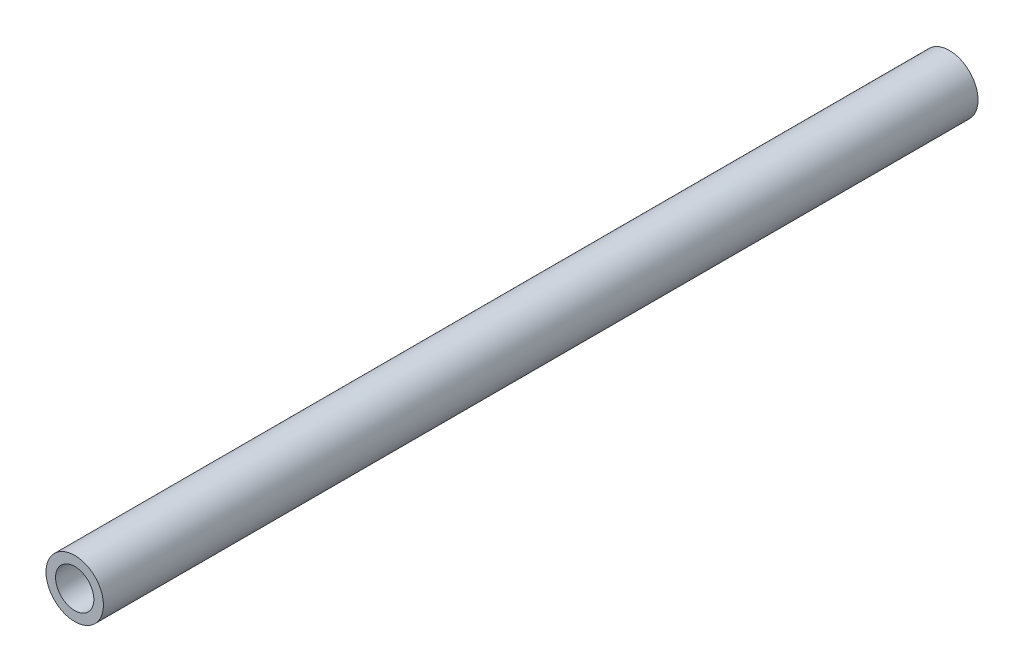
ISO-10303-21;
HEADER;
FILE_DESCRIPTION(('STEP AP214'),'2;1');
FILE_NAME('part.step','',(''),(''),'','','');
FILE_SCHEMA(('AUTOMOTIVE_DESIGN { 1 0 10303 214 1 1 1 1 }'));
ENDSEC;
DATA;
#1=APPLICATION_CONTEXT('core data for automotive mechanical design processes');
#2=APPLICATION_PROTOCOL_DEFINITION('international standard','automotive_design',2000,#1);
#3=PRODUCT_CONTEXT('',#1,'mechanical');
#4=PRODUCT('Part','Part','',(#3));
#5=PRODUCT_RELATED_PRODUCT_CATEGORY('part','',(#4));
#6=PRODUCT_DEFINITION_FORMATION('','',#4);
#7=PRODUCT_DEFINITION_CONTEXT('part definition',#1,'design');
#8=PRODUCT_DEFINITION('design','',#6,#7);
#9=PRODUCT_DEFINITION_SHAPE('','',#8);
#10=(LENGTH_UNIT() NAMED_UNIT(*) SI_UNIT(.MILLI.,.METRE.));
#11=(NAMED_UNIT(*) PLANE_ANGLE_UNIT() SI_UNIT($,.RADIAN.));
#12=(NAMED_UNIT(*) SI_UNIT($,.STERADIAN.) SOLID_ANGLE_UNIT());
#13=UNCERTAINTY_MEASURE_WITH_UNIT(LENGTH_MEASURE(1.E-05),#10,'distance_accuracy_value','');
#14=(GEOMETRIC_REPRESENTATION_CONTEXT(3) GLOBAL_UNCERTAINTY_ASSIGNED_CONTEXT((#13)) GLOBAL_UNIT_ASSIGNED_CONTEXT((#10,
#11,#12)) REPRESENTATION_CONTEXT('',''));
#15=CARTESIAN_POINT('',(0.,0.,0.));
#16=DIRECTION('',(0.,0.,1.));
#17=DIRECTION('',(1.,0.,0.));
#18=AXIS2_PLACEMENT_3D('',#15,#16,#17);
#19=CARTESIAN_POINT('',(0.,0.,45.7));
#20=DIRECTION('',(0.,0.,1.));
#21=DIRECTION('',(1.,0.,0.));
#22=AXIS2_PLACEMENT_3D('',#19,#20,#21);
#23=PLANE('',#22);
#24=CARTESIAN_POINT('',(0.,0.,45.7));
#25=DIRECTION('',(0.,0.,1.));
#26=DIRECTION('',(1.,0.,0.));
#27=AXIS2_PLACEMENT_3D('',#24,#25,#26);
#28=CIRCLE('',#27,3.);
#29=CARTESIAN_POINT('',(-3.,0.,45.7));
#30=VERTEX_POINT('',#29);
#31=EDGE_CURVE('E10',#30,#30,#28,.T.);
#32=ORIENTED_EDGE('',*,*,#31,.T.);
#33=EDGE_LOOP('',(#32));
#34=FACE_BOUND('',#33,.T.);
#35=CARTESIAN_POINT('',(0.,0.,45.7));
#36=DIRECTION('',(0.,0.,1.));
#37=DIRECTION('',(1.,0.,0.));
#38=AXIS2_PLACEMENT_3D('',#35,#36,#37);
#39=CIRCLE('',#38,2.);
#40=CARTESIAN_POINT('',(-2.,0.,45.7));
#41=VERTEX_POINT('',#40);
#42=EDGE_CURVE('E40',#41,#41,#39,.T.);
#43=ORIENTED_EDGE('',*,*,#42,.F.);
#44=EDGE_LOOP('',(#43));
#45=FACE_BOUND('',#44,.T.);
#46=ADVANCED_FACE('F29',(#34,#45),#23,.T.);
#47=CARTESIAN_POINT('',(0.,0.,-45.7));
#48=DIRECTION('',(0.,0.,1.));
#49=DIRECTION('',(1.,0.,0.));
#50=AXIS2_PLACEMENT_3D('',#47,#48,#49);
#51=PLANE('',#50);
#52=CARTESIAN_POINT('',(0.,0.,-45.7));
#53=DIRECTION('',(0.,0.,1.));
#54=DIRECTION('',(1.,0.,0.));
#55=AXIS2_PLACEMENT_3D('',#52,#53,#54);
#56=CIRCLE('',#55,3.);
#57=CARTESIAN_POINT('',(-3.,0.,-45.7));
#58=VERTEX_POINT('',#57);
#59=EDGE_CURVE('E33',#58,#58,#56,.T.);
#60=ORIENTED_EDGE('',*,*,#59,.F.);
#61=EDGE_LOOP('',(#60));
#62=FACE_BOUND('',#61,.T.);
#63=CARTESIAN_POINT('',(0.,0.,-45.7));
#64=DIRECTION('',(0.,0.,1.));
#65=DIRECTION('',(1.,0.,0.));
#66=AXIS2_PLACEMENT_3D('',#63,#64,#65);
#67=CIRCLE('',#66,2.);
#68=CARTESIAN_POINT('',(-2.,0.,-45.7));
#69=VERTEX_POINT('',#68);
#70=EDGE_CURVE('E42',#69,#69,#67,.T.);
#71=ORIENTED_EDGE('',*,*,#70,.T.);
#72=EDGE_LOOP('',(#71));
#73=FACE_BOUND('',#72,.T.);
#74=ADVANCED_FACE('F52',(#62,#73),#51,.F.);
#75=CARTESIAN_POINT('',(0.,0.,45.7));
#76=DIRECTION('',(0.,0.,-1.));
#77=DIRECTION('',(-1.,0.,0.));
#78=AXIS2_PLACEMENT_3D('',#75,#76,#77);
#79=CYLINDRICAL_SURFACE('',#78,3.);
#80=CARTESIAN_POINT('',(-3.,0.,45.7));
#81=CARTESIAN_POINT('',(-3.,0.,44.7479166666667));
#82=CARTESIAN_POINT('',(-3.,0.,43.7958333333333));
#83=CARTESIAN_POINT('',(-3.,0.,41.8916666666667));
#84=CARTESIAN_POINT('',(-3.,0.,40.9395833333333));
#85=CARTESIAN_POINT('',(-3.,0.,39.0354166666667));
#86=CARTESIAN_POINT('',(-3.,0.,38.0833333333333));
#87=CARTESIAN_POINT('',(-3.,0.,36.1791666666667));
#88=CARTESIAN_POINT('',(-3.,0.,35.2270833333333));
#89=CARTESIAN_POINT('',(-3.,0.,33.3229166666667));
#90=CARTESIAN_POINT('',(-3.,0.,32.3708333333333));
#91=CARTESIAN_POINT('',(-3.,0.,30.4666666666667));
#92=CARTESIAN_POINT('',(-3.,0.,29.5145833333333));
#93=CARTESIAN_POINT('',(-3.,0.,27.6104166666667));
#94=CARTESIAN_POINT('',(-3.,0.,26.6583333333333));
#95=CARTESIAN_POINT('',(-3.,0.,24.7541666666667));
#96=CARTESIAN_POINT('',(-3.,0.,23.8020833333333));
#97=CARTESIAN_POINT('',(-3.,0.,21.8979166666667));
#98=CARTESIAN_POINT('',(-3.,0.,20.9458333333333));
#99=CARTESIAN_POINT('',(-3.,0.,19.0416666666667));
#100=CARTESIAN_POINT('',(-3.,0.,18.0895833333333));
#101=CARTESIAN_POINT('',(-3.,0.,16.1854166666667));
#102=CARTESIAN_POINT('',(-3.,0.,15.2333333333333));
#103=CARTESIAN_POINT('',(-3.,0.,13.3291666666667));
#104=CARTESIAN_POINT('',(-3.,0.,12.3770833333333));
#105=CARTESIAN_POINT('',(-3.,0.,10.4729166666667));
#106=CARTESIAN_POINT('',(-3.,0.,9.52083333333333));
#107=CARTESIAN_POINT('',(-3.,0.,7.61666666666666));
#108=CARTESIAN_POINT('',(-3.,0.,6.66458333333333));
#109=CARTESIAN_POINT('',(-3.,0.,4.76041666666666));
#110=CARTESIAN_POINT('',(-3.,0.,3.80833333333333));
#111=CARTESIAN_POINT('',(-3.,0.,1.90416666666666));
#112=CARTESIAN_POINT('',(-3.,0.,0.952083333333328));
#113=CARTESIAN_POINT('',(-3.,0.,-0.952083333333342));
#114=CARTESIAN_POINT('',(-3.,0.,-1.90416666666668));
#115=CARTESIAN_POINT('',(-3.,0.,-3.80833333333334));
#116=CARTESIAN_POINT('',(-3.,0.,-4.76041666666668));
#117=CARTESIAN_POINT('',(-3.,0.,-6.66458333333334));
#118=CARTESIAN_POINT('',(-3.,0.,-7.61666666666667));
#119=CARTESIAN_POINT('',(-3.,0.,-9.52083333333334));
#120=CARTESIAN_POINT('',(-3.,0.,-10.4729166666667));
#121=CARTESIAN_POINT('',(-3.,0.,-12.3770833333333));
#122=CARTESIAN_POINT('',(-3.,0.,-13.3291666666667));
#123=CARTESIAN_POINT('',(-3.,0.,-15.2333333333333));
#124=CARTESIAN_POINT('',(-3.,0.,-16.1854166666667));
#125=CARTESIAN_POINT('',(-3.,0.,-18.0895833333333));
#126=CARTESIAN_POINT('',(-3.,0.,-19.0416666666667));
#127=CARTESIAN_POINT('',(-3.,0.,-20.9458333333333));
#128=CARTESIAN_POINT('',(-3.,0.,-21.8979166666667));
#129=CARTESIAN_POINT('',(-3.,0.,-23.8020833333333));
#130=CARTESIAN_POINT('',(-3.,0.,-24.7541666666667));
#131=CARTESIAN_POINT('',(-3.,0.,-26.6583333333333));
#132=CARTESIAN_POINT('',(-3.,0.,-27.6104166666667));
#133=CARTESIAN_POINT('',(-3.,0.,-29.5145833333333));
#134=CARTESIAN_POINT('',(-3.,0.,-30.4666666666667));
#135=CARTESIAN_POINT('',(-3.,0.,-32.3708333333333));
#136=CARTESIAN_POINT('',(-3.,0.,-33.3229166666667));
#137=CARTESIAN_POINT('',(-3.,0.,-35.2270833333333));
#138=CARTESIAN_POINT('',(-3.,0.,-36.1791666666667));
#139=CARTESIAN_POINT('',(-3.,0.,-38.0833333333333));
#140=CARTESIAN_POINT('',(-3.,0.,-39.0354166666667));
#141=CARTESIAN_POINT('',(-3.,0.,-40.9395833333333));
#142=CARTESIAN_POINT('',(-3.,0.,-41.8916666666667));
#143=CARTESIAN_POINT('',(-3.,0.,-43.7958333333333));
#144=CARTESIAN_POINT('',(-3.,0.,-44.7479166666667));
#145=CARTESIAN_POINT('',(-3.,0.,-45.7));
#146=B_SPLINE_CURVE_WITH_KNOTS('',3,(#80,#81,#82,#83,#84,#85,#86,#87,#88,#89,#90,#91,#92,#93,
#94,#95,#96,#97,#98,#99,#100,#101,#102,#103,#104,#105,#106,#107,#108,#109,#110,#111,#112,#113,
#114,#115,#116,#117,#118,#119,#120,#121,#122,#123,#124,#125,#126,#127,#128,#129,#130,#131,#132,
#133,#134,#135,#136,#137,#138,#139,#140,#141,#142,#143,#144,#145),.UNSPECIFIED.,.F.,.F.,(4,2,2,
2,2,2,2,2,2,2,2,2,2,2,2,2,2,2,2,2,2,2,2,2,2,2,2,2,2,2,2,2,4),(0.,2.85625,5.7125,
8.56875000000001,11.425,14.28125,17.1375,19.99375,22.85,25.70625,28.5625,31.41875,34.275,
37.13125,39.9875,42.84375,45.7,48.55625,51.4125,54.26875,57.125,59.98125,62.8375,65.69375,68.55,
71.40625,74.2625,77.11875,79.975,82.83125,85.6875,88.54375,91.4),.UNSPECIFIED.);
#147=EDGE_CURVE('BSEAM31',#30,#58,#146,.T.);
#148=ORIENTED_EDGE('',*,*,#31,.F.);
#149=ORIENTED_EDGE('',*,*,#59,.T.);
#150=ORIENTED_EDGE('',*,*,#147,.T.);
#151=ORIENTED_EDGE('',*,*,#147,.F.);
#152=EDGE_LOOP('',(#148,#150,#149,#151));
#153=FACE_BOUND('',#152,.T.);
#154=ADVANCED_FACE('F31',(#153),#79,.T.);
#155=CARTESIAN_POINT('',(0.,0.,45.7));
#156=DIRECTION('',(0.,0.,-1.));
#157=DIRECTION('',(-1.,0.,0.));
#158=AXIS2_PLACEMENT_3D('',#155,#156,#157);
#159=CYLINDRICAL_SURFACE('',#158,2.);
#160=CARTESIAN_POINT('',(-2.,0.,45.7));
#161=CARTESIAN_POINT('',(-2.,0.,44.7479166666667));
#162=CARTESIAN_POINT('',(-2.,0.,43.7958333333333));
#163=CARTESIAN_POINT('',(-2.,0.,41.8916666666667));
#164=CARTESIAN_POINT('',(-2.,0.,40.9395833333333));
#165=CARTESIAN_POINT('',(-2.,0.,39.0354166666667));
#166=CARTESIAN_POINT('',(-2.,0.,38.0833333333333));
#167=CARTESIAN_POINT('',(-2.,0.,36.1791666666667));
#168=CARTESIAN_POINT('',(-2.,0.,35.2270833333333));
#169=CARTESIAN_POINT('',(-2.,0.,33.3229166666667));
#170=CARTESIAN_POINT('',(-2.,0.,32.3708333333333));
#171=CARTESIAN_POINT('',(-2.,0.,30.4666666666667));
#172=CARTESIAN_POINT('',(-2.,0.,29.5145833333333));
#173=CARTESIAN_POINT('',(-2.,0.,27.6104166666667));
#174=CARTESIAN_POINT('',(-2.,0.,26.6583333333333));
#175=CARTESIAN_POINT('',(-2.,0.,24.7541666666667));
#176=CARTESIAN_POINT('',(-2.,0.,23.8020833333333));
#177=CARTESIAN_POINT('',(-2.,0.,21.8979166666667));
#178=CARTESIAN_POINT('',(-2.,0.,20.9458333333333));
#179=CARTESIAN_POINT('',(-2.,0.,19.0416666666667));
#180=CARTESIAN_POINT('',(-2.,0.,18.0895833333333));
#181=CARTESIAN_POINT('',(-2.,0.,16.1854166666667));
#182=CARTESIAN_POINT('',(-2.,0.,15.2333333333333));
#183=CARTESIAN_POINT('',(-2.,0.,13.3291666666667));
#184=CARTESIAN_POINT('',(-2.,0.,12.3770833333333));
#185=CARTESIAN_POINT('',(-2.,0.,10.4729166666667));
#186=CARTESIAN_POINT('',(-2.,0.,9.52083333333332));
#187=CARTESIAN_POINT('',(-2.,0.,7.61666666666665));
#188=CARTESIAN_POINT('',(-2.,0.,6.66458333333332));
#189=CARTESIAN_POINT('',(-2.,0.,4.76041666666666));
#190=CARTESIAN_POINT('',(-2.,0.,3.80833333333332));
#191=CARTESIAN_POINT('',(-2.,0.,1.90416666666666));
#192=CARTESIAN_POINT('',(-2.,0.,0.952083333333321));
#193=CARTESIAN_POINT('',(-2.,0.,-0.952083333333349));
#194=CARTESIAN_POINT('',(-2.,0.,-1.90416666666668));
#195=CARTESIAN_POINT('',(-2.,0.,-3.80833333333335));
#196=CARTESIAN_POINT('',(-2.,0.,-4.76041666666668));
#197=CARTESIAN_POINT('',(-2.,0.,-6.66458333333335));
#198=CARTESIAN_POINT('',(-2.,0.,-7.61666666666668));
#199=CARTESIAN_POINT('',(-2.,0.,-9.52083333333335));
#200=CARTESIAN_POINT('',(-2.,0.,-10.4729166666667));
#201=CARTESIAN_POINT('',(-2.,0.,-12.3770833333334));
#202=CARTESIAN_POINT('',(-2.,0.,-13.3291666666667));
#203=CARTESIAN_POINT('',(-2.,0.,-15.2333333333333));
#204=CARTESIAN_POINT('',(-2.,0.,-16.1854166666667));
#205=CARTESIAN_POINT('',(-2.,0.,-18.0895833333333));
#206=CARTESIAN_POINT('',(-2.,0.,-19.0416666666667));
#207=CARTESIAN_POINT('',(-2.,0.,-20.9458333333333));
#208=CARTESIAN_POINT('',(-2.,0.,-21.8979166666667));
#209=CARTESIAN_POINT('',(-2.,0.,-23.8020833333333));
#210=CARTESIAN_POINT('',(-2.,0.,-24.7541666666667));
#211=CARTESIAN_POINT('',(-2.,0.,-26.6583333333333));
#212=CARTESIAN_POINT('',(-2.,0.,-27.6104166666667));
#213=CARTESIAN_POINT('',(-2.,0.,-29.5145833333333));
#214=CARTESIAN_POINT('',(-2.,0.,-30.4666666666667));
#215=CARTESIAN_POINT('',(-2.,0.,-32.3708333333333));
#216=CARTESIAN_POINT('',(-2.,0.,-33.3229166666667));
#217=CARTESIAN_POINT('',(-2.,0.,-35.2270833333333));
#218=CARTESIAN_POINT('',(-2.,0.,-36.1791666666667));
#219=CARTESIAN_POINT('',(-2.,0.,-38.0833333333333));
#220=CARTESIAN_POINT('',(-2.,0.,-39.0354166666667));
#221=CARTESIAN_POINT('',(-2.,0.,-40.9395833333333));
#222=CARTESIAN_POINT('',(-2.,0.,-41.8916666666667));
#223=CARTESIAN_POINT('',(-2.,0.,-43.7958333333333));
#224=CARTESIAN_POINT('',(-2.,0.,-44.7479166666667));
#225=CARTESIAN_POINT('',(-2.,0.,-45.7));
#226=B_SPLINE_CURVE_WITH_KNOTS('',3,(#160,#161,#162,#163,#164,#165,#166,#167,#168,#169,#170,
#171,#172,#173,#174,#175,#176,#177,#178,#179,#180,#181,#182,#183,#184,#185,#186,#187,#188,#189,
#190,#191,#192,#193,#194,#195,#196,#197,#198,#199,#200,#201,#202,#203,#204,#205,#206,#207,#208,
#209,#210,#211,#212,#213,#214,#215,#216,#217,#218,#219,#220,#221,#222,#223,#224,#225),
.UNSPECIFIED.,.F.,.F.,(4,2,2,2,2,2,2,2,2,2,2,2,2,2,2,2,2,2,2,2,2,2,2,2,2,2,2,2,2,2,2,2,4),(0.,
2.85625,5.7125,8.56875,11.425,14.28125,17.1375,19.99375,22.85,25.70625,28.5625,31.41875,34.275,
37.13125,39.9875,42.84375,45.7,48.55625,51.4125,54.26875,57.125,59.98125,62.8375,65.69375,68.55,
71.40625,74.2625,77.11875,79.975,82.83125,85.6875,88.54375,91.4),.UNSPECIFIED.);
#227=EDGE_CURVE('BSEAM48',#41,#69,#226,.T.);
#228=ORIENTED_EDGE('',*,*,#42,.T.);
#229=ORIENTED_EDGE('',*,*,#70,.F.);
#230=ORIENTED_EDGE('',*,*,#227,.T.);
#231=ORIENTED_EDGE('',*,*,#227,.F.);
#232=EDGE_LOOP('',(#228,#230,#229,#231));
#233=FACE_BOUND('',#232,.T.);
#234=ADVANCED_FACE('F48',(#233),#159,.F.);
#235=CLOSED_SHELL('',(#46,#74,#154,#234));
#236=MANIFOLD_SOLID_BREP('B2',#235);
#237=ADVANCED_BREP_SHAPE_REPRESENTATION('',(#18,#236),#14);
#238=SHAPE_DEFINITION_REPRESENTATION(#9,#237);
ENDSEC;
END-ISO-10303-21;
